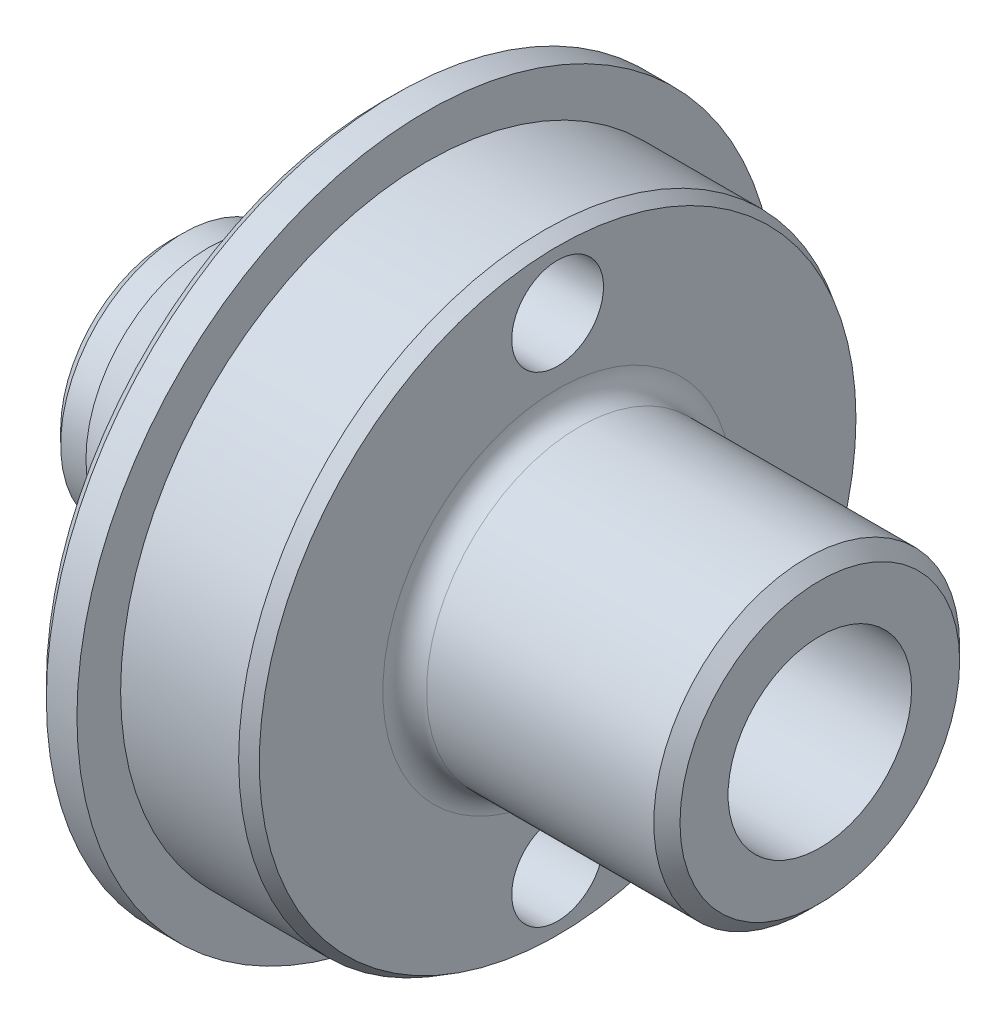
ISO-10303-21;
HEADER;
FILE_DESCRIPTION(('STEP AP214'),'2;1');
FILE_NAME('part.step','',(''),(''),'','','');
FILE_SCHEMA(('AUTOMOTIVE_DESIGN { 1 0 10303 214 1 1 1 1 }'));
ENDSEC;
DATA;
#1=APPLICATION_CONTEXT('core data for automotive mechanical design processes');
#2=APPLICATION_PROTOCOL_DEFINITION('international standard','automotive_design',2000,#1);
#3=PRODUCT_CONTEXT('',#1,'mechanical');
#4=PRODUCT('Part','Part','',(#3));
#5=PRODUCT_RELATED_PRODUCT_CATEGORY('part','',(#4));
#6=PRODUCT_DEFINITION_FORMATION('','',#4);
#7=PRODUCT_DEFINITION_CONTEXT('part definition',#1,'design');
#8=PRODUCT_DEFINITION('design','',#6,#7);
#9=PRODUCT_DEFINITION_SHAPE('','',#8);
#10=(LENGTH_UNIT() NAMED_UNIT(*) SI_UNIT(.MILLI.,.METRE.));
#11=(NAMED_UNIT(*) PLANE_ANGLE_UNIT() SI_UNIT($,.RADIAN.));
#12=(NAMED_UNIT(*) SI_UNIT($,.STERADIAN.) SOLID_ANGLE_UNIT());
#13=UNCERTAINTY_MEASURE_WITH_UNIT(LENGTH_MEASURE(1.E-05),#10,'distance_accuracy_value','');
#14=(GEOMETRIC_REPRESENTATION_CONTEXT(3) GLOBAL_UNCERTAINTY_ASSIGNED_CONTEXT((#13)) GLOBAL_UNIT_ASSIGNED_CONTEXT((#10,
#11,#12)) REPRESENTATION_CONTEXT('',''));
#15=CARTESIAN_POINT('',(0.,0.,0.));
#16=DIRECTION('',(0.,0.,1.));
#17=DIRECTION('',(1.,0.,0.));
#18=AXIS2_PLACEMENT_3D('',#15,#16,#17);
#19=CARTESIAN_POINT('',(5.,8.,0.));
#20=DIRECTION('',(-1.,0.,0.));
#21=DIRECTION('',(0.,0.,1.));
#22=AXIS2_PLACEMENT_3D('',#19,#20,#21);
#23=PLANE('',#22);
#24=CARTESIAN_POINT('',(5.,0.,0.));
#25=DIRECTION('',(-1.,0.,0.));
#26=DIRECTION('',(0.,0.,1.));
#27=AXIS2_PLACEMENT_3D('',#24,#25,#26);
#28=CIRCLE('',#27,7.7);
#29=CARTESIAN_POINT('',(5.,0.,7.7));
#30=VERTEX_POINT('',#29);
#31=EDGE_CURVE('E46',#30,#30,#28,.T.);
#32=ORIENTED_EDGE('',*,*,#31,.T.);
#33=EDGE_LOOP('',(#32));
#34=FACE_BOUND('',#33,.T.);
#35=CARTESIAN_POINT('',(5.00000000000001,5.5,0.));
#36=DIRECTION('',(1.,0.,0.));
#37=DIRECTION('',(0.,0.,-1.));
#38=AXIS2_PLACEMENT_3D('',#35,#36,#37);
#39=CIRCLE('',#38,1.05000000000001);
#40=CARTESIAN_POINT('',(5.00000000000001,5.5,-1.05000000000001));
#41=VERTEX_POINT('',#40);
#42=EDGE_CURVE('E105',#41,#41,#39,.T.);
#43=ORIENTED_EDGE('',*,*,#42,.T.);
#44=EDGE_LOOP('',(#43));
#45=FACE_BOUND('',#44,.T.);
#46=CARTESIAN_POINT('',(5.00000000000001,-5.5,0.));
#47=DIRECTION('',(1.,0.,0.));
#48=DIRECTION('',(0.,0.,-1.));
#49=AXIS2_PLACEMENT_3D('',#46,#47,#48);
#50=CIRCLE('',#49,1.05000000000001);
#51=CARTESIAN_POINT('',(5.00000000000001,-5.5,-1.05000000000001));
#52=VERTEX_POINT('',#51);
#53=EDGE_CURVE('E99',#52,#52,#50,.T.);
#54=ORIENTED_EDGE('',*,*,#53,.T.);
#55=EDGE_LOOP('',(#54));
#56=FACE_BOUND('',#55,.T.);
#57=CARTESIAN_POINT('',(5.,0.,0.));
#58=DIRECTION('',(-1.,0.,0.));
#59=DIRECTION('',(0.,0.,1.));
#60=AXIS2_PLACEMENT_3D('',#57,#58,#59);
#61=CIRCLE('',#60,4.25);
#62=CARTESIAN_POINT('',(5.,0.,4.25));
#63=VERTEX_POINT('',#62);
#64=EDGE_CURVE('E82',#63,#63,#61,.T.);
#65=ORIENTED_EDGE('',*,*,#64,.F.);
#66=EDGE_LOOP('',(#65));
#67=FACE_BOUND('',#66,.T.);
#68=ADVANCED_FACE('F35',(#34,#45,#56,#67),#23,.T.);
#69=CARTESIAN_POINT('',(9.,0.,0.));
#70=DIRECTION('',(1.,0.,0.));
#71=DIRECTION('',(0.,0.,-1.));
#72=AXIS2_PLACEMENT_3D('',#69,#70,#71);
#73=PLANE('',#72);
#74=CARTESIAN_POINT('',(9.,0.,0.));
#75=DIRECTION('',(1.,0.,0.));
#76=DIRECTION('',(0.,0.,-1.));
#77=AXIS2_PLACEMENT_3D('',#74,#75,#76);
#78=CIRCLE('',#77,4.);
#79=CARTESIAN_POINT('',(9.,0.,-4.));
#80=VERTEX_POINT('',#79);
#81=EDGE_CURVE('E61',#80,#80,#78,.F.);
#82=ORIENTED_EDGE('',*,*,#81,.T.);
#83=EDGE_LOOP('',(#82));
#84=FACE_BOUND('',#83,.T.);
#85=CARTESIAN_POINT('',(9.,0.,0.));
#86=DIRECTION('',(1.,0.,0.));
#87=DIRECTION('',(0.,0.,-1.));
#88=AXIS2_PLACEMENT_3D('',#85,#86,#87);
#89=CIRCLE('',#88,6.82679491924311);
#90=CARTESIAN_POINT('',(9.,0.,-6.82679491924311));
#91=VERTEX_POINT('',#90);
#92=EDGE_CURVE('E70',#91,#91,#89,.T.);
#93=ORIENTED_EDGE('',*,*,#92,.T.);
#94=EDGE_LOOP('',(#93));
#95=FACE_BOUND('',#94,.T.);
#96=CARTESIAN_POINT('',(9.,5.5,0.));
#97=DIRECTION('',(1.,0.,0.));
#98=DIRECTION('',(0.,0.,-1.));
#99=AXIS2_PLACEMENT_3D('',#96,#97,#98);
#100=CIRCLE('',#99,1.05000000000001);
#101=CARTESIAN_POINT('',(9.,5.5,-1.05000000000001));
#102=VERTEX_POINT('',#101);
#103=EDGE_CURVE('E77',#102,#102,#100,.T.);
#104=ORIENTED_EDGE('',*,*,#103,.F.);
#105=EDGE_LOOP('',(#104));
#106=FACE_BOUND('',#105,.T.);
#107=CARTESIAN_POINT('',(9.,-5.5,0.));
#108=DIRECTION('',(1.,0.,0.));
#109=DIRECTION('',(0.,0.,-1.));
#110=AXIS2_PLACEMENT_3D('',#107,#108,#109);
#111=CIRCLE('',#110,1.05000000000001);
#112=CARTESIAN_POINT('',(9.,-5.5,-1.05000000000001));
#113=VERTEX_POINT('',#112);
#114=EDGE_CURVE('E102',#113,#113,#111,.T.);
#115=ORIENTED_EDGE('',*,*,#114,.F.);
#116=EDGE_LOOP('',(#115));
#117=FACE_BOUND('',#116,.T.);
#118=ADVANCED_FACE('F135',(#84,#95,#106,#117),#73,.T.);
#119=CARTESIAN_POINT('',(6.,0.,0.));
#120=DIRECTION('',(1.,0.,0.));
#121=DIRECTION('',(0.,0.,-1.));
#122=AXIS2_PLACEMENT_3D('',#119,#120,#121);
#123=PLANE('',#122);
#124=CARTESIAN_POINT('',(6.,0.,0.));
#125=DIRECTION('',(1.,0.,0.));
#126=DIRECTION('',(0.,0.,-1.));
#127=AXIS2_PLACEMENT_3D('',#124,#125,#126);
#128=CIRCLE('',#127,8.);
#129=CARTESIAN_POINT('',(6.,0.,-8.));
#130=VERTEX_POINT('',#129);
#131=EDGE_CURVE('E73',#130,#130,#128,.T.);
#132=ORIENTED_EDGE('',*,*,#131,.T.);
#133=EDGE_LOOP('',(#132));
#134=FACE_BOUND('',#133,.T.);
#135=CARTESIAN_POINT('',(6.,0.,0.));
#136=DIRECTION('',(1.,0.,0.));
#137=DIRECTION('',(0.,0.,-1.));
#138=AXIS2_PLACEMENT_3D('',#135,#136,#137);
#139=CIRCLE('',#138,7.);
#140=CARTESIAN_POINT('',(6.,0.,-7.));
#141=VERTEX_POINT('',#140);
#142=EDGE_CURVE('E86',#141,#141,#139,.T.);
#143=ORIENTED_EDGE('',*,*,#142,.F.);
#144=EDGE_LOOP('',(#143));
#145=FACE_BOUND('',#144,.T.);
#146=ADVANCED_FACE('F141',(#134,#145),#123,.T.);
#147=CARTESIAN_POINT('',(5.,0.,0.));
#148=DIRECTION('',(1.,0.,0.));
#149=DIRECTION('',(0.,0.,-1.));
#150=AXIS2_PLACEMENT_3D('',#147,#148,#149);
#151=CYLINDRICAL_SURFACE('',#150,8.);
#152=CARTESIAN_POINT('',(5.3,0.,0.));
#153=DIRECTION('',(-1.,0.,0.));
#154=DIRECTION('',(0.,0.,1.));
#155=AXIS2_PLACEMENT_3D('',#152,#153,#154);
#156=CIRCLE('',#155,8.);
#157=CARTESIAN_POINT('',(5.3,0.,8.));
#158=VERTEX_POINT('',#157);
#159=EDGE_CURVE('E50',#158,#158,#156,.F.);
#160=ORIENTED_EDGE('',*,*,#159,.T.);
#161=EDGE_LOOP('',(#160));
#162=FACE_BOUND('',#161,.T.);
#163=ORIENTED_EDGE('',*,*,#131,.F.);
#164=EDGE_LOOP('',(#163));
#165=FACE_BOUND('',#164,.T.);
#166=ADVANCED_FACE('F148',(#162,#165),#151,.T.);
#167=CARTESIAN_POINT('',(9.,0.,0.));
#168=DIRECTION('',(-1.,0.,0.));
#169=DIRECTION('',(0.,0.,1.));
#170=AXIS2_PLACEMENT_3D('',#167,#168,#169);
#171=CYLINDRICAL_SURFACE('',#170,7.);
#172=CARTESIAN_POINT('',(8.69999999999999,0.,0.));
#173=DIRECTION('',(1.,0.,0.));
#174=DIRECTION('',(0.,0.,-1.));
#175=AXIS2_PLACEMENT_3D('',#172,#173,#174);
#176=CIRCLE('',#175,7.);
#177=CARTESIAN_POINT('',(8.69999999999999,0.,-7.));
#178=VERTEX_POINT('',#177);
#179=EDGE_CURVE('E67',#178,#178,#176,.F.);
#180=ORIENTED_EDGE('',*,*,#179,.T.);
#181=EDGE_LOOP('',(#180));
#182=FACE_BOUND('',#181,.T.);
#183=ORIENTED_EDGE('',*,*,#142,.T.);
#184=EDGE_LOOP('',(#183));
#185=FACE_BOUND('',#184,.T.);
#186=ADVANCED_FACE('F131',(#182,#185),#171,.T.);
#187=CARTESIAN_POINT('',(15.,0.,0.));
#188=DIRECTION('',(-1.,0.,0.));
#189=DIRECTION('',(0.,0.,1.));
#190=AXIS2_PLACEMENT_3D('',#187,#188,#189);
#191=CYLINDRICAL_SURFACE('',#190,3.5);
#192=CARTESIAN_POINT('',(14.7,0.,0.));
#193=DIRECTION('',(1.,0.,0.));
#194=DIRECTION('',(0.,0.,-1.));
#195=AXIS2_PLACEMENT_3D('',#192,#193,#194);
#196=CIRCLE('',#195,3.5);
#197=CARTESIAN_POINT('',(14.7,0.,-3.5));
#198=VERTEX_POINT('',#197);
#199=EDGE_CURVE('E55',#198,#198,#196,.F.);
#200=ORIENTED_EDGE('',*,*,#199,.T.);
#201=EDGE_LOOP('',(#200));
#202=FACE_BOUND('',#201,.T.);
#203=CARTESIAN_POINT('',(9.5,0.,0.));
#204=DIRECTION('',(1.,0.,0.));
#205=DIRECTION('',(0.,0.,-1.));
#206=AXIS2_PLACEMENT_3D('',#203,#204,#205);
#207=CIRCLE('',#206,3.5);
#208=CARTESIAN_POINT('',(9.5,0.,-3.5));
#209=VERTEX_POINT('',#208);
#210=EDGE_CURVE('E64',#209,#209,#207,.T.);
#211=ORIENTED_EDGE('',*,*,#210,.T.);
#212=EDGE_LOOP('',(#211));
#213=FACE_BOUND('',#212,.T.);
#214=ADVANCED_FACE('F121',(#202,#213),#191,.T.);
#215=CARTESIAN_POINT('',(15.,0.,0.));
#216=DIRECTION('',(1.,0.,0.));
#217=DIRECTION('',(0.,0.,-1.));
#218=AXIS2_PLACEMENT_3D('',#215,#216,#217);
#219=PLANE('',#218);
#220=CARTESIAN_POINT('',(15.,0.,0.));
#221=DIRECTION('',(1.,0.,0.));
#222=DIRECTION('',(0.,0.,-1.));
#223=AXIS2_PLACEMENT_3D('',#220,#221,#222);
#224=CIRCLE('',#223,3.2);
#225=CARTESIAN_POINT('',(15.,0.,-3.2));
#226=VERTEX_POINT('',#225);
#227=EDGE_CURVE('E58',#226,#226,#224,.T.);
#228=ORIENTED_EDGE('',*,*,#227,.T.);
#229=EDGE_LOOP('',(#228));
#230=FACE_BOUND('',#229,.T.);
#231=CARTESIAN_POINT('',(15.,0.,0.));
#232=DIRECTION('',(1.,0.,0.));
#233=DIRECTION('',(0.,0.,-1.));
#234=AXIS2_PLACEMENT_3D('',#231,#232,#233);
#235=CIRCLE('',#234,2.09999999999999);
#236=CARTESIAN_POINT('',(15.,0.,-2.09999999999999));
#237=VERTEX_POINT('',#236);
#238=EDGE_CURVE('E112',#237,#237,#235,.T.);
#239=ORIENTED_EDGE('',*,*,#238,.F.);
#240=EDGE_LOOP('',(#239));
#241=FACE_BOUND('',#240,.T.);
#242=ADVANCED_FACE('F118',(#230,#241),#219,.T.);
#243=CARTESIAN_POINT('',(5.,0.,0.));
#244=DIRECTION('',(1.,0.,0.));
#245=DIRECTION('',(0.,0.,1.));
#246=AXIS2_PLACEMENT_3D('',#243,#244,#245);
#247=CONICAL_SURFACE('',#246,4.25,0.349065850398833);
#248=CARTESIAN_POINT('',(1.,0.,0.));
#249=DIRECTION('',(-1.,0.,0.));
#250=DIRECTION('',(0.,0.,1.));
#251=AXIS2_PLACEMENT_3D('',#248,#249,#250);
#252=CIRCLE('',#251,2.79411906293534);
#253=CARTESIAN_POINT('',(1.,0.,-2.79411906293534));
#254=VERTEX_POINT('',#253);
#255=EDGE_CURVE('E89',#254,#254,#252,.T.);
#256=ORIENTED_EDGE('',*,*,#255,.F.);
#257=EDGE_LOOP('',(#256));
#258=FACE_BOUND('',#257,.T.);
#259=ORIENTED_EDGE('',*,*,#64,.T.);
#260=EDGE_LOOP('',(#259));
#261=FACE_BOUND('',#260,.T.);
#262=ADVANCED_FACE('F120',(#258,#261),#247,.T.);
#263=CARTESIAN_POINT('',(0.1212161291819,0.,0.));
#264=DIRECTION('',(1.,0.,0.));
#265=DIRECTION('',(0.,0.,-1.));
#266=AXIS2_PLACEMENT_3D('',#263,#264,#265);
#267=CYLINDRICAL_SURFACE('',#266,2.79411906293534);
#268=CARTESIAN_POINT('',(0.42121612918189,0.,0.));
#269=DIRECTION('',(-1.,0.,0.));
#270=DIRECTION('',(0.,0.,1.));
#271=AXIS2_PLACEMENT_3D('',#268,#269,#270);
#272=CIRCLE('',#271,2.79411906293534);
#273=CARTESIAN_POINT('',(0.42121612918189,0.,-2.79411906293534));
#274=VERTEX_POINT('',#273);
#275=EDGE_CURVE('E10',#274,#274,#272,.F.);
#276=CARTESIAN_POINT('',(0.42121612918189,0.,-2.79411906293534));
#277=CARTESIAN_POINT('',(0.427245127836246,0.,-2.79411906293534));
#278=CARTESIAN_POINT('',(0.433274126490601,0.,-2.79411906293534));
#279=CARTESIAN_POINT('',(0.445332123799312,0.,-2.79411906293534));
#280=CARTESIAN_POINT('',(0.451361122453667,0.,-2.79411906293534));
#281=CARTESIAN_POINT('',(0.463419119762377,0.,-2.79411906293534));
#282=CARTESIAN_POINT('',(0.469448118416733,0.,-2.79411906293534));
#283=CARTESIAN_POINT('',(0.481506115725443,0.,-2.79411906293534));
#284=CARTESIAN_POINT('',(0.487535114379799,0.,-2.79411906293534));
#285=CARTESIAN_POINT('',(0.499593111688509,0.,-2.79411906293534));
#286=CARTESIAN_POINT('',(0.505622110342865,0.,-2.79411906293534));
#287=CARTESIAN_POINT('',(0.517680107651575,0.,-2.79411906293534));
#288=CARTESIAN_POINT('',(0.523709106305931,0.,-2.79411906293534));
#289=CARTESIAN_POINT('',(0.535767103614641,0.,-2.79411906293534));
#290=CARTESIAN_POINT('',(0.541796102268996,0.,-2.79411906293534));
#291=CARTESIAN_POINT('',(0.553854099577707,0.,-2.79411906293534));
#292=CARTESIAN_POINT('',(0.559883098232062,0.,-2.79411906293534));
#293=CARTESIAN_POINT('',(0.571941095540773,0.,-2.79411906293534));
#294=CARTESIAN_POINT('',(0.577970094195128,0.,-2.79411906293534));
#295=CARTESIAN_POINT('',(0.590028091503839,0.,-2.79411906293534));
#296=CARTESIAN_POINT('',(0.596057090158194,0.,-2.79411906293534));
#297=CARTESIAN_POINT('',(0.608115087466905,0.,-2.79411906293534));
#298=CARTESIAN_POINT('',(0.61414408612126,0.,-2.79411906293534));
#299=CARTESIAN_POINT('',(0.626202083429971,0.,-2.79411906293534));
#300=CARTESIAN_POINT('',(0.632231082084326,0.,-2.79411906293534));
#301=CARTESIAN_POINT('',(0.644289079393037,0.,-2.79411906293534));
#302=CARTESIAN_POINT('',(0.650318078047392,0.,-2.79411906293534));
#303=CARTESIAN_POINT('',(0.662376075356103,0.,-2.79411906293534));
#304=CARTESIAN_POINT('',(0.668405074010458,0.,-2.79411906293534));
#305=CARTESIAN_POINT('',(0.680463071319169,0.,-2.79411906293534));
#306=CARTESIAN_POINT('',(0.686492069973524,0.,-2.79411906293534));
#307=CARTESIAN_POINT('',(0.698550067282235,0.,-2.79411906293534));
#308=CARTESIAN_POINT('',(0.70457906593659,0.,-2.79411906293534));
#309=CARTESIAN_POINT('',(0.716637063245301,0.,-2.79411906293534));
#310=CARTESIAN_POINT('',(0.722666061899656,0.,-2.79411906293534));
#311=CARTESIAN_POINT('',(0.734724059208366,0.,-2.79411906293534));
#312=CARTESIAN_POINT('',(0.740753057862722,0.,-2.79411906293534));
#313=CARTESIAN_POINT('',(0.752811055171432,0.,-2.79411906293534));
#314=CARTESIAN_POINT('',(0.758840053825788,0.,-2.79411906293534));
#315=CARTESIAN_POINT('',(0.770898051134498,0.,-2.79411906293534));
#316=CARTESIAN_POINT('',(0.776927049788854,0.,-2.79411906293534));
#317=CARTESIAN_POINT('',(0.788985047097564,0.,-2.79411906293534));
#318=CARTESIAN_POINT('',(0.79501404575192,0.,-2.79411906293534));
#319=CARTESIAN_POINT('',(0.80707204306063,0.,-2.79411906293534));
#320=CARTESIAN_POINT('',(0.813101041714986,0.,-2.79411906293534));
#321=CARTESIAN_POINT('',(0.825159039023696,0.,-2.79411906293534));
#322=CARTESIAN_POINT('',(0.831188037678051,0.,-2.79411906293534));
#323=CARTESIAN_POINT('',(0.843246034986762,0.,-2.79411906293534));
#324=CARTESIAN_POINT('',(0.849275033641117,0.,-2.79411906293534));
#325=CARTESIAN_POINT('',(0.861333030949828,0.,-2.79411906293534));
#326=CARTESIAN_POINT('',(0.867362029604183,0.,-2.79411906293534));
#327=CARTESIAN_POINT('',(0.879420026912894,0.,-2.79411906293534));
#328=CARTESIAN_POINT('',(0.885449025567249,0.,-2.79411906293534));
#329=CARTESIAN_POINT('',(0.89750702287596,0.,-2.79411906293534));
#330=CARTESIAN_POINT('',(0.903536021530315,0.,-2.79411906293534));
#331=CARTESIAN_POINT('',(0.915594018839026,0.,-2.79411906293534));
#332=CARTESIAN_POINT('',(0.921623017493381,0.,-2.79411906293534));
#333=CARTESIAN_POINT('',(0.933681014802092,0.,-2.79411906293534));
#334=CARTESIAN_POINT('',(0.939710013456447,0.,-2.79411906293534));
#335=CARTESIAN_POINT('',(0.951768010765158,0.,-2.79411906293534));
#336=CARTESIAN_POINT('',(0.957797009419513,0.,-2.79411906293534));
#337=CARTESIAN_POINT('',(0.969855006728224,0.,-2.79411906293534));
#338=CARTESIAN_POINT('',(0.975884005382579,0.,-2.79411906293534));
#339=CARTESIAN_POINT('',(0.98794200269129,0.,-2.79411906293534));
#340=CARTESIAN_POINT('',(0.993971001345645,0.,-2.79411906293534));
#341=CARTESIAN_POINT('',(1.,0.,-2.79411906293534));
#342=B_SPLINE_CURVE_WITH_KNOTS('',3,(#276,#277,#278,#279,#280,#281,#282,#283,#284,#285,#286,
#287,#288,#289,#290,#291,#292,#293,#294,#295,#296,#297,#298,#299,#300,#301,#302,#303,#304,#305,
#306,#307,#308,#309,#310,#311,#312,#313,#314,#315,#316,#317,#318,#319,#320,#321,#322,#323,#324,
#325,#326,#327,#328,#329,#330,#331,#332,#333,#334,#335,#336,#337,#338,#339,#340,#341),
.UNSPECIFIED.,.F.,.F.,(4,2,2,2,2,2,2,2,2,2,2,2,2,2,2,2,2,2,2,2,2,2,2,2,2,2,2,2,2,2,2,2,4),(0.,
0.0180869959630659,0.0361739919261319,0.0542609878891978,0.0723479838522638,0.0904349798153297,
0.108521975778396,0.126608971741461,0.144695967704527,0.162782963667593,0.180869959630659,
0.198956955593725,0.217043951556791,0.235130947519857,0.253217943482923,0.271304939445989,
0.289391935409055,0.307478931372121,0.325565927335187,0.343652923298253,0.361739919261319,
0.379826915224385,0.397913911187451,0.416000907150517,0.434087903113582,0.452174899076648,
0.470261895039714,0.48834889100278,0.506435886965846,0.524522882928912,0.542609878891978,
0.560696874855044,0.57878387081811),.UNSPECIFIED.);
#343=EDGE_CURVE('BSEAM128',#274,#254,#342,.T.);
#344=ORIENTED_EDGE('',*,*,#275,.T.);
#345=ORIENTED_EDGE('',*,*,#255,.T.);
#346=ORIENTED_EDGE('',*,*,#343,.T.);
#347=ORIENTED_EDGE('',*,*,#343,.F.);
#348=EDGE_LOOP('',(#344,#346,#345,#347));
#349=FACE_BOUND('',#348,.T.);
#350=ADVANCED_FACE('F128',(#349),#267,.T.);
#351=CARTESIAN_POINT('',(0.1212161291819,0.,0.));
#352=DIRECTION('',(-1.,0.,0.));
#353=DIRECTION('',(0.,0.,1.));
#354=AXIS2_PLACEMENT_3D('',#351,#352,#353);
#355=PLANE('',#354);
#356=CARTESIAN_POINT('',(0.1212161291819,0.,0.));
#357=DIRECTION('',(-1.,0.,0.));
#358=DIRECTION('',(0.,0.,1.));
#359=AXIS2_PLACEMENT_3D('',#356,#357,#358);
#360=CIRCLE('',#359,2.49411906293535);
#361=CARTESIAN_POINT('',(0.1212161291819,0.,2.49411906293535));
#362=VERTEX_POINT('',#361);
#363=EDGE_CURVE('E42',#362,#362,#360,.T.);
#364=ORIENTED_EDGE('',*,*,#363,.T.);
#365=EDGE_LOOP('',(#364));
#366=FACE_BOUND('',#365,.T.);
#367=CARTESIAN_POINT('',(0.1212161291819,0.,0.));
#368=DIRECTION('',(-1.,0.,0.));
#369=DIRECTION('',(0.,0.,1.));
#370=AXIS2_PLACEMENT_3D('',#367,#368,#369);
#371=CIRCLE('',#370,1.5);
#372=CARTESIAN_POINT('',(0.1212161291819,0.,1.5));
#373=VERTEX_POINT('',#372);
#374=EDGE_CURVE('E79',#373,#373,#371,.T.);
#375=ORIENTED_EDGE('',*,*,#374,.F.);
#376=EDGE_LOOP('',(#375));
#377=FACE_BOUND('',#376,.T.);
#378=ADVANCED_FACE('F218',(#366,#377),#355,.T.);
#379=CARTESIAN_POINT('',(0.,0.,0.));
#380=DIRECTION('',(1.,0.,0.));
#381=DIRECTION('',(0.,0.,-1.));
#382=AXIS2_PLACEMENT_3D('',#379,#380,#381);
#383=CYLINDRICAL_SURFACE('',#382,1.5);
#384=ORIENTED_EDGE('',*,*,#374,.T.);
#385=EDGE_LOOP('',(#384));
#386=FACE_BOUND('',#385,.T.);
#387=CARTESIAN_POINT('',(5.5,0.,0.));
#388=DIRECTION('',(1.,0.,0.));
#389=DIRECTION('',(0.,0.,-1.));
#390=AXIS2_PLACEMENT_3D('',#387,#388,#389);
#391=CIRCLE('',#390,1.5);
#392=CARTESIAN_POINT('',(5.5,0.,-1.5));
#393=VERTEX_POINT('',#392);
#394=EDGE_CURVE('E96',#393,#393,#391,.T.);
#395=ORIENTED_EDGE('',*,*,#394,.T.);
#396=EDGE_LOOP('',(#395));
#397=FACE_BOUND('',#396,.T.);
#398=ADVANCED_FACE('F214',(#386,#397),#383,.F.);
#399=CARTESIAN_POINT('',(0.,0.,0.));
#400=DIRECTION('',(1.,0.,0.));
#401=DIRECTION('',(0.,0.,-1.));
#402=AXIS2_PLACEMENT_3D('',#399,#400,#401);
#403=CYLINDRICAL_SURFACE('',#402,0.75);
#404=CARTESIAN_POINT('',(6.68883816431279,0.,0.));
#405=DIRECTION('',(1.,0.,0.));
#406=DIRECTION('',(0.,0.,-1.));
#407=AXIS2_PLACEMENT_3D('',#404,#405,#406);
#408=CIRCLE('',#407,0.75);
#409=CARTESIAN_POINT('',(6.68883816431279,0.,-0.75));
#410=VERTEX_POINT('',#409);
#411=EDGE_CURVE('E74',#410,#410,#408,.T.);
#412=ORIENTED_EDGE('',*,*,#411,.T.);
#413=EDGE_LOOP('',(#412));
#414=FACE_BOUND('',#413,.T.);
#415=CARTESIAN_POINT('',(5.5,0.,0.));
#416=DIRECTION('',(1.,0.,0.));
#417=DIRECTION('',(0.,0.,-1.));
#418=AXIS2_PLACEMENT_3D('',#415,#416,#417);
#419=CIRCLE('',#418,0.749999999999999);
#420=CARTESIAN_POINT('',(5.5,0.,-0.749999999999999));
#421=VERTEX_POINT('',#420);
#422=EDGE_CURVE('E83',#421,#421,#419,.T.);
#423=ORIENTED_EDGE('',*,*,#422,.F.);
#424=EDGE_LOOP('',(#423));
#425=FACE_BOUND('',#424,.T.);
#426=ADVANCED_FACE('F206',(#414,#425),#403,.F.);
#427=CARTESIAN_POINT('',(5.5,0.749999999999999,0.));
#428=DIRECTION('',(1.,0.,0.));
#429=DIRECTION('',(0.,0.,-1.));
#430=AXIS2_PLACEMENT_3D('',#427,#428,#429);
#431=PLANE('',#430);
#432=ORIENTED_EDGE('',*,*,#394,.F.);
#433=EDGE_LOOP('',(#432));
#434=FACE_BOUND('',#433,.T.);
#435=ORIENTED_EDGE('',*,*,#422,.T.);
#436=EDGE_LOOP('',(#435));
#437=FACE_BOUND('',#436,.T.);
#438=ADVANCED_FACE('F196',(#434,#437),#431,.F.);
#439=CARTESIAN_POINT('',(9.,-5.5,0.));
#440=DIRECTION('',(1.,0.,0.));
#441=DIRECTION('',(0.,0.,-1.));
#442=AXIS2_PLACEMENT_3D('',#439,#440,#441);
#443=CYLINDRICAL_SURFACE('',#442,1.05000000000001);
#444=ORIENTED_EDGE('',*,*,#53,.F.);
#445=EDGE_LOOP('',(#444));
#446=FACE_BOUND('',#445,.T.);
#447=ORIENTED_EDGE('',*,*,#114,.T.);
#448=EDGE_LOOP('',(#447));
#449=FACE_BOUND('',#448,.T.);
#450=ADVANCED_FACE('F193',(#446,#449),#443,.F.);
#451=CARTESIAN_POINT('',(9.,5.5,0.));
#452=DIRECTION('',(1.,0.,0.));
#453=DIRECTION('',(0.,0.,-1.));
#454=AXIS2_PLACEMENT_3D('',#451,#452,#453);
#455=CYLINDRICAL_SURFACE('',#454,1.05000000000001);
#456=ORIENTED_EDGE('',*,*,#42,.F.);
#457=EDGE_LOOP('',(#456));
#458=FACE_BOUND('',#457,.T.);
#459=ORIENTED_EDGE('',*,*,#103,.T.);
#460=EDGE_LOOP('',(#459));
#461=FACE_BOUND('',#460,.T.);
#462=ADVANCED_FACE('F195',(#458,#461),#455,.F.);
#463=CARTESIAN_POINT('',(7.5,0.,0.));
#464=DIRECTION('',(1.,0.,0.));
#465=DIRECTION('',(0.,0.,-1.));
#466=AXIS2_PLACEMENT_3D('',#463,#464,#465);
#467=CONICAL_SURFACE('',#466,2.1,1.02974425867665);
#468=CARTESIAN_POINT('',(7.5,0.,0.));
#469=DIRECTION('',(1.,0.,0.));
#470=DIRECTION('',(0.,0.,-1.));
#471=AXIS2_PLACEMENT_3D('',#468,#469,#470);
#472=CIRCLE('',#471,2.1);
#473=CARTESIAN_POINT('',(7.5,0.,-2.1));
#474=VERTEX_POINT('',#473);
#475=EDGE_CURVE('E78',#474,#474,#472,.T.);
#476=ORIENTED_EDGE('',*,*,#475,.T.);
#477=EDGE_LOOP('',(#476));
#478=FACE_BOUND('',#477,.T.);
#479=ORIENTED_EDGE('',*,*,#411,.F.);
#480=EDGE_LOOP('',(#479));
#481=FACE_BOUND('',#480,.T.);
#482=ADVANCED_FACE('F203',(#478,#481),#467,.F.);
#483=CARTESIAN_POINT('',(15.,0.,0.));
#484=DIRECTION('',(1.,0.,0.));
#485=DIRECTION('',(0.,0.,-1.));
#486=AXIS2_PLACEMENT_3D('',#483,#484,#485);
#487=CYLINDRICAL_SURFACE('',#486,2.09999999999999);
#488=ORIENTED_EDGE('',*,*,#475,.F.);
#489=EDGE_LOOP('',(#488));
#490=FACE_BOUND('',#489,.T.);
#491=ORIENTED_EDGE('',*,*,#238,.T.);
#492=EDGE_LOOP('',(#491));
#493=FACE_BOUND('',#492,.T.);
#494=ADVANCED_FACE('F116',(#490,#493),#487,.F.);
#495=CARTESIAN_POINT('',(9.,0.,0.));
#496=DIRECTION('',(-1.,0.,0.));
#497=DIRECTION('',(0.,0.,1.));
#498=AXIS2_PLACEMENT_3D('',#495,#496,#497);
#499=CONICAL_SURFACE('',#498,6.82679491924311,0.523598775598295);
#500=ORIENTED_EDGE('',*,*,#179,.F.);
#501=EDGE_LOOP('',(#500));
#502=FACE_BOUND('',#501,.T.);
#503=ORIENTED_EDGE('',*,*,#92,.F.);
#504=EDGE_LOOP('',(#503));
#505=FACE_BOUND('',#504,.T.);
#506=ADVANCED_FACE('F152',(#502,#505),#499,.T.);
#507=CARTESIAN_POINT('',(9.5,0.,0.));
#508=DIRECTION('',(1.,0.,0.));
#509=DIRECTION('',(0.,0.,-1.));
#510=AXIS2_PLACEMENT_3D('',#507,#508,#509);
#511=TOROIDAL_SURFACE('',#510,4.,0.5);
#512=ORIENTED_EDGE('',*,*,#81,.F.);
#513=EDGE_LOOP('',(#512));
#514=FACE_BOUND('',#513,.T.);
#515=ORIENTED_EDGE('',*,*,#210,.F.);
#516=EDGE_LOOP('',(#515));
#517=FACE_BOUND('',#516,.T.);
#518=ADVANCED_FACE('F155',(#514,#517),#511,.F.);
#519=CARTESIAN_POINT('',(15.,0.,0.));
#520=DIRECTION('',(-1.,0.,0.));
#521=DIRECTION('',(0.,0.,1.));
#522=AXIS2_PLACEMENT_3D('',#519,#520,#521);
#523=CONICAL_SURFACE('',#522,3.2,0.785398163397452);
#524=ORIENTED_EDGE('',*,*,#199,.F.);
#525=EDGE_LOOP('',(#524));
#526=FACE_BOUND('',#525,.T.);
#527=ORIENTED_EDGE('',*,*,#227,.F.);
#528=EDGE_LOOP('',(#527));
#529=FACE_BOUND('',#528,.T.);
#530=ADVANCED_FACE('F159',(#526,#529),#523,.T.);
#531=CARTESIAN_POINT('',(5.3,0.,0.));
#532=DIRECTION('',(1.,0.,0.));
#533=DIRECTION('',(0.,0.,-1.));
#534=AXIS2_PLACEMENT_3D('',#531,#532,#533);
#535=CONICAL_SURFACE('',#534,8.,0.785398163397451);
#536=ORIENTED_EDGE('',*,*,#31,.F.);
#537=EDGE_LOOP('',(#536));
#538=FACE_BOUND('',#537,.T.);
#539=ORIENTED_EDGE('',*,*,#159,.F.);
#540=EDGE_LOOP('',(#539));
#541=FACE_BOUND('',#540,.T.);
#542=ADVANCED_FACE('F162',(#538,#541),#535,.T.);
#543=CARTESIAN_POINT('',(0.1212161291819,0.,0.));
#544=DIRECTION('',(1.,0.,0.));
#545=DIRECTION('',(0.,0.,-1.));
#546=AXIS2_PLACEMENT_3D('',#543,#544,#545);
#547=CONICAL_SURFACE('',#546,2.49411906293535,0.785398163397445);
#548=ORIENTED_EDGE('',*,*,#275,.F.);
#549=EDGE_LOOP('',(#548));
#550=FACE_BOUND('',#549,.T.);
#551=ORIENTED_EDGE('',*,*,#363,.F.);
#552=EDGE_LOOP('',(#551));
#553=FACE_BOUND('',#552,.T.);
#554=ADVANCED_FACE('F37',(#550,#553),#547,.T.);
#555=CLOSED_SHELL('',(#68,#118,#146,#166,#186,#214,#242,#262,#350,#378,#398,#426,#438,#450,#462,
#482,#494,#506,#518,#530,#542,#554));
#556=MANIFOLD_SOLID_BREP('B2',#555);
#557=ADVANCED_BREP_SHAPE_REPRESENTATION('',(#18,#556),#14);
#558=SHAPE_DEFINITION_REPRESENTATION(#9,#557);
ENDSEC;
END-ISO-10303-21;
